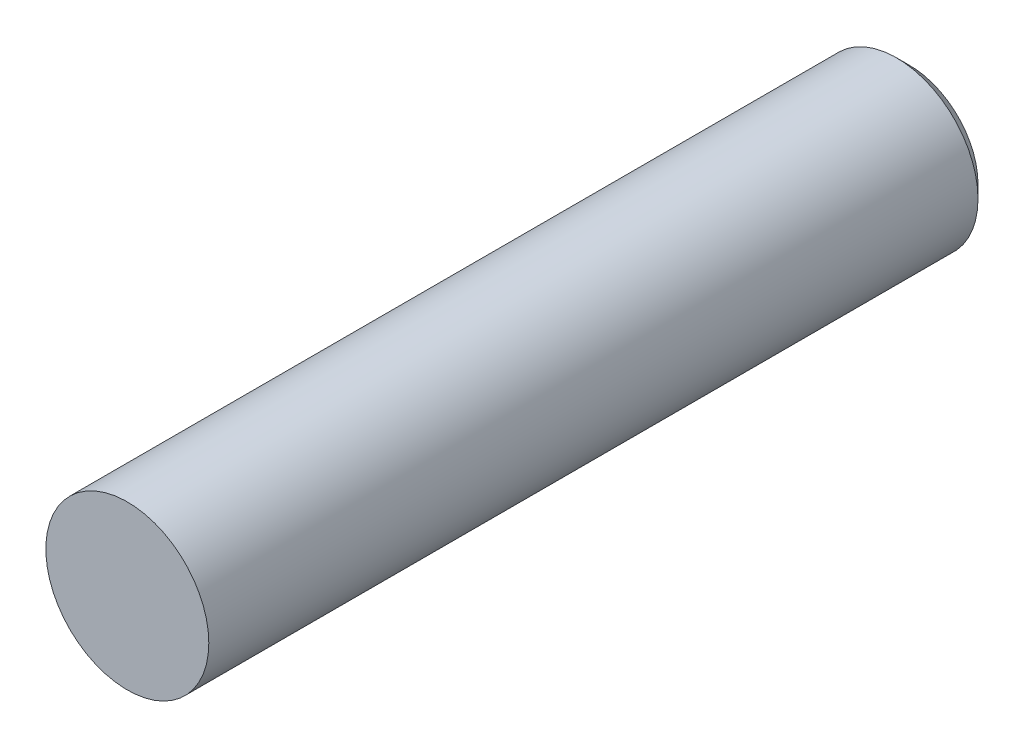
ISO-10303-21;
HEADER;
FILE_DESCRIPTION(('STEP AP214'),'2;1');
FILE_NAME('part.step','',(''),(''),'','','');
FILE_SCHEMA(('AUTOMOTIVE_DESIGN { 1 0 10303 214 1 1 1 1 }'));
ENDSEC;
DATA;
#1=APPLICATION_CONTEXT('core data for automotive mechanical design processes');
#2=APPLICATION_PROTOCOL_DEFINITION('international standard','automotive_design',2000,#1);
#3=PRODUCT_CONTEXT('',#1,'mechanical');
#4=PRODUCT('Part','Part','',(#3));
#5=PRODUCT_RELATED_PRODUCT_CATEGORY('part','',(#4));
#6=PRODUCT_DEFINITION_FORMATION('','',#4);
#7=PRODUCT_DEFINITION_CONTEXT('part definition',#1,'design');
#8=PRODUCT_DEFINITION('design','',#6,#7);
#9=PRODUCT_DEFINITION_SHAPE('','',#8);
#10=(LENGTH_UNIT() NAMED_UNIT(*) SI_UNIT(.MILLI.,.METRE.));
#11=(NAMED_UNIT(*) PLANE_ANGLE_UNIT() SI_UNIT($,.RADIAN.));
#12=(NAMED_UNIT(*) SI_UNIT($,.STERADIAN.) SOLID_ANGLE_UNIT());
#13=UNCERTAINTY_MEASURE_WITH_UNIT(LENGTH_MEASURE(1.E-05),#10,'distance_accuracy_value','');
#14=(GEOMETRIC_REPRESENTATION_CONTEXT(3) GLOBAL_UNCERTAINTY_ASSIGNED_CONTEXT((#13)) GLOBAL_UNIT_ASSIGNED_CONTEXT((#10,
#11,#12)) REPRESENTATION_CONTEXT('',''));
#15=CARTESIAN_POINT('',(0.,0.,0.));
#16=DIRECTION('',(0.,0.,1.));
#17=DIRECTION('',(1.,0.,0.));
#18=AXIS2_PLACEMENT_3D('',#15,#16,#17);
#19=CARTESIAN_POINT('',(0.,0.,120.));
#20=DIRECTION('',(0.,0.,-1.));
#21=DIRECTION('',(-1.,0.,0.));
#22=AXIS2_PLACEMENT_3D('',#19,#20,#21);
#23=CYLINDRICAL_SURFACE('',#22,12.5);
#24=CARTESIAN_POINT('',(0.,0.,2.));
#25=DIRECTION('',(0.,0.,1.));
#26=DIRECTION('',(1.,0.,0.));
#27=AXIS2_PLACEMENT_3D('',#24,#25,#26);
#28=CIRCLE('',#27,12.5);
#29=CARTESIAN_POINT('',(12.5,0.,2.));
#30=VERTEX_POINT('',#29);
#31=EDGE_CURVE('E33',#30,#30,#28,.T.);
#32=ORIENTED_EDGE('',*,*,#31,.T.);
#33=EDGE_LOOP('',(#32));
#34=FACE_BOUND('',#33,.T.);
#35=CARTESIAN_POINT('',(0.,0.,120.));
#36=DIRECTION('',(0.,0.,1.));
#37=DIRECTION('',(1.,0.,0.));
#38=AXIS2_PLACEMENT_3D('',#35,#36,#37);
#39=CIRCLE('',#38,12.5);
#40=CARTESIAN_POINT('',(12.5,0.,120.));
#41=VERTEX_POINT('',#40);
#42=EDGE_CURVE('E37',#41,#41,#39,.T.);
#43=ORIENTED_EDGE('',*,*,#42,.F.);
#44=EDGE_LOOP('',(#43));
#45=FACE_BOUND('',#44,.T.);
#46=ADVANCED_FACE('F27',(#34,#45),#23,.T.);
#47=CARTESIAN_POINT('',(0.,0.,120.));
#48=DIRECTION('',(0.,0.,1.));
#49=DIRECTION('',(1.,0.,0.));
#50=AXIS2_PLACEMENT_3D('',#47,#48,#49);
#51=PLANE('',#50);
#52=ORIENTED_EDGE('',*,*,#42,.T.);
#53=EDGE_LOOP('',(#52));
#54=FACE_BOUND('',#53,.T.);
#55=ADVANCED_FACE('F44',(#54),#51,.T.);
#56=CARTESIAN_POINT('',(0.,0.,0.));
#57=DIRECTION('',(0.,0.,1.));
#58=DIRECTION('',(1.,0.,0.));
#59=AXIS2_PLACEMENT_3D('',#56,#57,#58);
#60=PLANE('',#59);
#61=CARTESIAN_POINT('',(0.,0.,0.));
#62=DIRECTION('',(0.,0.,1.));
#63=DIRECTION('',(1.,0.,0.));
#64=AXIS2_PLACEMENT_3D('',#61,#62,#63);
#65=CIRCLE('',#64,10.5);
#66=CARTESIAN_POINT('',(10.5,0.,0.));
#67=VERTEX_POINT('',#66);
#68=EDGE_CURVE('E10',#67,#67,#65,.F.);
#69=ORIENTED_EDGE('',*,*,#68,.T.);
#70=EDGE_LOOP('',(#69));
#71=FACE_BOUND('',#70,.T.);
#72=ADVANCED_FACE('F50',(#71),#60,.F.);
#73=CARTESIAN_POINT('',(0.,0.,2.));
#74=DIRECTION('',(0.,0.,1.));
#75=DIRECTION('',(1.,0.,0.));
#76=AXIS2_PLACEMENT_3D('',#73,#74,#75);
#77=CONICAL_SURFACE('',#76,12.5,0.785398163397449);
#78=ORIENTED_EDGE('',*,*,#68,.F.);
#79=EDGE_LOOP('',(#78));
#80=FACE_BOUND('',#79,.T.);
#81=ORIENTED_EDGE('',*,*,#31,.F.);
#82=EDGE_LOOP('',(#81));
#83=FACE_BOUND('',#82,.T.);
#84=ADVANCED_FACE('F54',(#80,#83),#77,.T.);
#85=CLOSED_SHELL('',(#46,#55,#72,#84));
#86=MANIFOLD_SOLID_BREP('B2',#85);
#87=ADVANCED_BREP_SHAPE_REPRESENTATION('',(#18,#86),#14);
#88=SHAPE_DEFINITION_REPRESENTATION(#9,#87);
ENDSEC;
END-ISO-10303-21;
